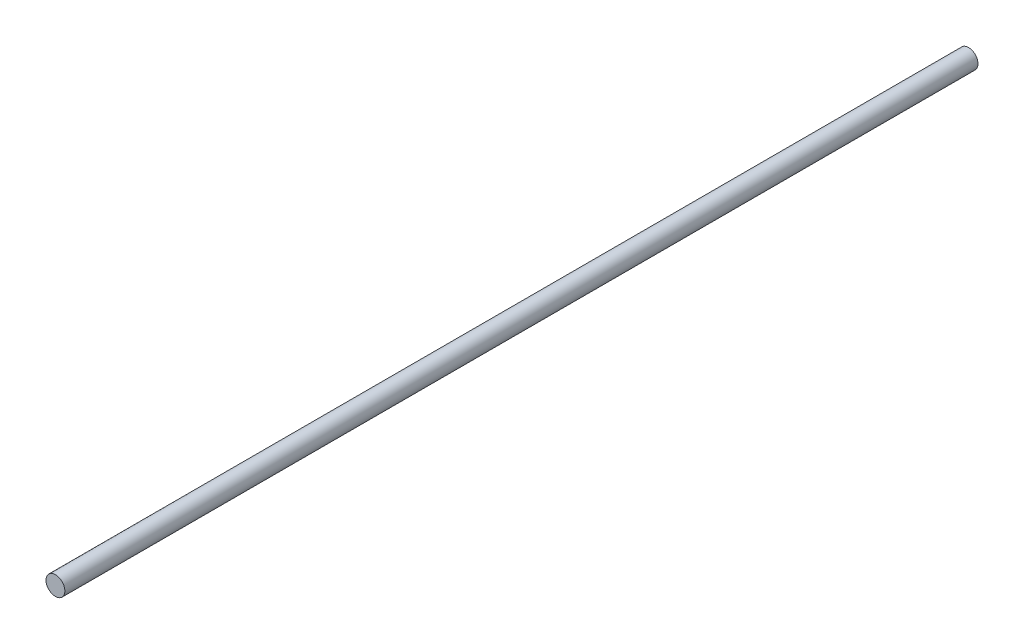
from build123d import *

# Parameters (mm, degrees)
SKETCH1_R           = 30
BOSS_EXTRUDE1_DEPTH = 2900


with BuildPart() as part:
    # Sketch1 → Boss-Extrude1 (new body)
    with BuildSketch(Plane.XY):
        Circle(SKETCH1_R)
    extrude(amount=-BOSS_EXTRUDE1_DEPTH)


solid = part.part
